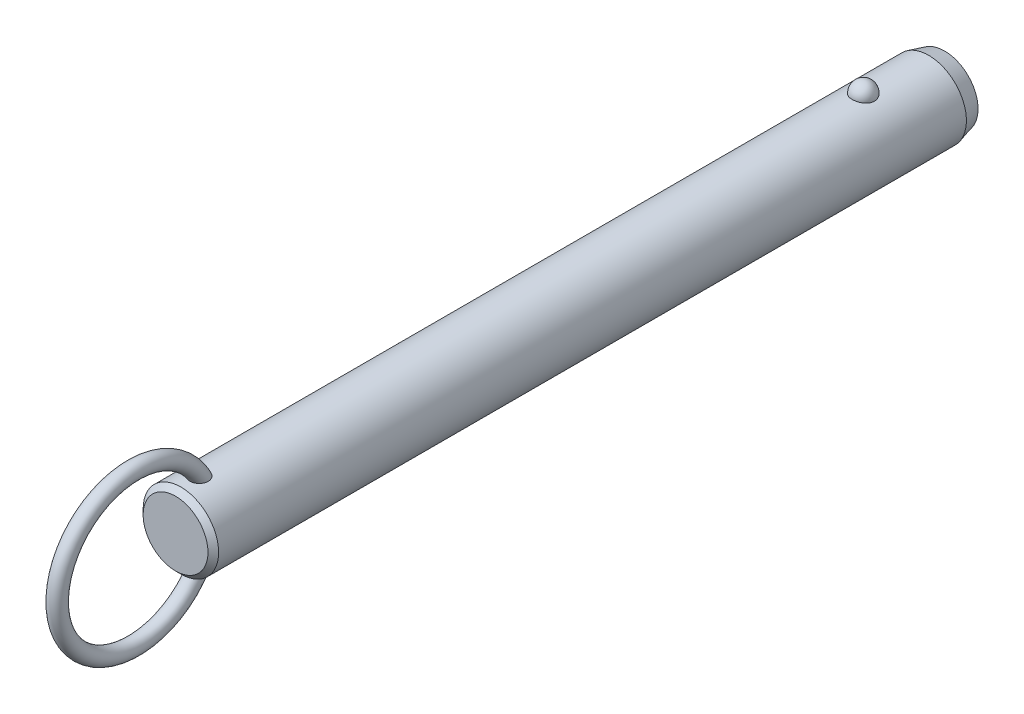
ISO-10303-21;
HEADER;
FILE_DESCRIPTION(('STEP AP214'),'2;1');
FILE_NAME('part.step','',(''),(''),'','','');
FILE_SCHEMA(('AUTOMOTIVE_DESIGN { 1 0 10303 214 1 1 1 1 }'));
ENDSEC;
DATA;
#1=APPLICATION_CONTEXT('core data for automotive mechanical design processes');
#2=APPLICATION_PROTOCOL_DEFINITION('international standard','automotive_design',2000,#1);
#3=PRODUCT_CONTEXT('',#1,'mechanical');
#4=PRODUCT('Part','Part','',(#3));
#5=PRODUCT_RELATED_PRODUCT_CATEGORY('part','',(#4));
#6=PRODUCT_DEFINITION_FORMATION('','',#4);
#7=PRODUCT_DEFINITION_CONTEXT('part definition',#1,'design');
#8=PRODUCT_DEFINITION('design','',#6,#7);
#9=PRODUCT_DEFINITION_SHAPE('','',#8);
#10=(LENGTH_UNIT() NAMED_UNIT(*) SI_UNIT(.MILLI.,.METRE.));
#11=(NAMED_UNIT(*) PLANE_ANGLE_UNIT() SI_UNIT($,.RADIAN.));
#12=(NAMED_UNIT(*) SI_UNIT($,.STERADIAN.) SOLID_ANGLE_UNIT());
#13=UNCERTAINTY_MEASURE_WITH_UNIT(LENGTH_MEASURE(1.E-05),#10,'distance_accuracy_value','');
#14=(GEOMETRIC_REPRESENTATION_CONTEXT(3) GLOBAL_UNCERTAINTY_ASSIGNED_CONTEXT((#13)) GLOBAL_UNIT_ASSIGNED_CONTEXT((#10,
#11,#12)) REPRESENTATION_CONTEXT('',''));
#15=CARTESIAN_POINT('',(0.,0.,0.));
#16=DIRECTION('',(0.,0.,1.));
#17=DIRECTION('',(1.,0.,0.));
#18=AXIS2_PLACEMENT_3D('',#15,#16,#17);
#19=CARTESIAN_POINT('',(0.,0.,119.4));
#20=DIRECTION('',(0.,0.,-1.));
#21=DIRECTION('',(-1.,0.,0.));
#22=AXIS2_PLACEMENT_3D('',#19,#20,#21);
#23=CYLINDRICAL_SURFACE('',#22,7.1);
#24=CARTESIAN_POINT('',(2.0769088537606,6.78943661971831,-2.1));
#25=CARTESIAN_POINT('',(2.07690739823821,6.78943796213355,-1.98268154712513));
#26=CARTESIAN_POINT('',(2.06738130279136,6.79237331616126,-1.86534506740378));
#27=CARTESIAN_POINT('',(2.0295040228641,6.8037853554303,-1.63400788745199));
#28=CARTESIAN_POINT('',(2.00114757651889,6.81226358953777,-1.52000812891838));
#29=CARTESIAN_POINT('',(1.92632025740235,6.83379798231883,-1.29863433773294));
#30=CARTESIAN_POINT('',(1.87985726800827,6.84685214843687,-1.19125744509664));
#31=CARTESIAN_POINT('',(1.76995205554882,6.87608091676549,-0.98604657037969));
#32=CARTESIAN_POINT('',(1.70650980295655,6.8922555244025,-0.88821260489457));
#33=CARTESIAN_POINT('',(1.5638119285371,6.92602930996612,-0.704242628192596));
#34=CARTESIAN_POINT('',(1.4844714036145,6.94363582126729,-0.618173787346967));
#35=CARTESIAN_POINT('',(1.31221746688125,6.97823658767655,-0.460740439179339));
#36=CARTESIAN_POINT('',(1.21930409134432,6.99523084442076,-0.389375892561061));
#37=CARTESIAN_POINT('',(1.02268781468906,7.02666176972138,-0.263547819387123));
#38=CARTESIAN_POINT('',(0.91902009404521,7.04110638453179,-0.209031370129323));
#39=CARTESIAN_POINT('',(0.703548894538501,7.06588726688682,-0.118163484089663));
#40=CARTESIAN_POINT('',(0.591746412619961,7.07622403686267,-0.0818098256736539));
#41=CARTESIAN_POINT('',(0.365557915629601,7.09147068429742,-0.0288711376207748));
#42=CARTESIAN_POINT('',(0.251267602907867,7.09648447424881,-0.0119070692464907));
#43=CARTESIAN_POINT('',(0.0213499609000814,7.10089837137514,0.00304925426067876));
#44=CARTESIAN_POINT('',(-0.0942772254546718,7.10029907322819,0.00104351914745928));
#45=CARTESIAN_POINT('',(-0.321651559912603,7.09360829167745,-0.0216931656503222));
#46=CARTESIAN_POINT('',(-0.433431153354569,7.08760388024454,-0.0421272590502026));
#47=CARTESIAN_POINT('',(-0.651862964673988,7.07086131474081,-0.100729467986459));
#48=CARTESIAN_POINT('',(-0.758515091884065,7.06012307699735,-0.138897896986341));
#49=CARTESIAN_POINT('',(-0.964449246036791,7.03496097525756,-0.232213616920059));
#50=CARTESIAN_POINT('',(-1.06368095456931,7.02051445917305,-0.287465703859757));
#51=CARTESIAN_POINT('',(-1.25145353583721,6.98948740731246,-0.413383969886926));
#52=CARTESIAN_POINT('',(-1.33999321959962,6.97290663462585,-0.48405186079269));
#53=CARTESIAN_POINT('',(-1.50591604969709,6.93898770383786,-0.640594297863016));
#54=CARTESIAN_POINT('',(-1.58302488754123,6.92164094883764,-0.726757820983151));
#55=CARTESIAN_POINT('',(-1.72189320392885,6.8884103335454,-0.91092752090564));
#56=CARTESIAN_POINT('',(-1.78365144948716,6.87252659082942,-1.008934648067));
#57=CARTESIAN_POINT('',(-1.89101272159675,6.84377189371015,-1.21549497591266));
#58=CARTESIAN_POINT('',(-1.93639553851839,6.83094274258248,-1.32416860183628));
#59=CARTESIAN_POINT('',(-2.00874275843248,6.81002070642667,-1.54791500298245));
#60=CARTESIAN_POINT('',(-2.03570774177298,6.80192767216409,-1.66298757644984));
#61=CARTESIAN_POINT('',(-2.07047276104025,6.7914266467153,-1.89571453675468));
#62=CARTESIAN_POINT('',(-2.07835878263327,6.78899315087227,-2.01335491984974));
#63=CARTESIAN_POINT('',(-2.07502083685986,6.79001409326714,-2.24833570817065));
#64=CARTESIAN_POINT('',(-2.06379746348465,6.7934683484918,-2.36567612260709));
#65=CARTESIAN_POINT('',(-2.02263913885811,6.80583442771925,-2.59603194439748));
#66=CARTESIAN_POINT('',(-1.99281127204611,6.81471501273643,-2.70906820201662));
#67=CARTESIAN_POINT('',(-1.91526639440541,6.83691232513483,-2.92836575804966));
#68=CARTESIAN_POINT('',(-1.8675486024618,6.85022924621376,-3.03462676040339));
#69=CARTESIAN_POINT('',(-1.75504492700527,6.87991336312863,-3.23806487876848));
#70=CARTESIAN_POINT('',(-1.69015924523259,6.89629822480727,-3.33518422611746));
#71=CARTESIAN_POINT('',(-1.54505404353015,6.93024852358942,-3.51697105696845));
#72=CARTESIAN_POINT('',(-1.46483385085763,6.94781401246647,-3.60163799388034));
#73=CARTESIAN_POINT('',(-1.29071406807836,6.98225977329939,-3.75654119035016));
#74=CARTESIAN_POINT('',(-1.19675650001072,6.99913673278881,-3.82671308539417));
#75=CARTESIAN_POINT('',(-0.997940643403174,7.03023618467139,-3.9501837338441));
#76=CARTESIAN_POINT('',(-0.89308318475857,7.04445887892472,-4.00348377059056));
#77=CARTESIAN_POINT('',(-0.676902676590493,7.06848365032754,-4.09107242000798));
#78=CARTESIAN_POINT('',(-0.565686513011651,7.0783430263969,-4.12560889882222));
#79=CARTESIAN_POINT('',(-0.338739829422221,7.09282534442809,-4.17575450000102));
#80=CARTESIAN_POINT('',(-0.223009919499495,7.09744899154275,-4.19136617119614));
#81=CARTESIAN_POINT('',(0.00707628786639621,7.10090930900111,-4.20307965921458));
#82=CARTESIAN_POINT('',(0.121410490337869,7.09986531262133,-4.19958377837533));
#83=CARTESIAN_POINT('',(0.347815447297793,7.092380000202,-4.17411564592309));
#84=CARTESIAN_POINT('',(0.459886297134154,7.08593891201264,-4.15214417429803));
#85=CARTESIAN_POINT('',(0.678084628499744,7.06838983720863,-4.09049562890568));
#86=CARTESIAN_POINT('',(0.784237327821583,7.05730369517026,-4.05090137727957));
#87=CARTESIAN_POINT('',(0.988305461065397,7.03163139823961,-3.95511447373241));
#88=CARTESIAN_POINT('',(1.08622031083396,7.01704499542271,-3.89892064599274));
#89=CARTESIAN_POINT('',(1.27284490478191,6.98562668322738,-3.77035541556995));
#90=CARTESIAN_POINT('',(1.36137372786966,6.96876135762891,-3.69772964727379));
#91=CARTESIAN_POINT('',(1.52509486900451,6.93477412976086,-3.53878279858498));
#92=CARTESIAN_POINT('',(1.60028496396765,6.91765218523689,-3.45245943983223));
#93=CARTESIAN_POINT('',(1.73681688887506,6.88465753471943,-3.26658774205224));
#94=CARTESIAN_POINT('',(1.79785966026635,6.86881574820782,-3.16681408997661));
#95=CARTESIAN_POINT('',(1.90265327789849,6.84053157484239,-2.95814408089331));
#96=CARTESIAN_POINT('',(1.94640861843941,6.82808830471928,-2.84925010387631));
#97=CARTESIAN_POINT('',(2.01274378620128,6.80881460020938,-2.63454318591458));
#98=CARTESIAN_POINT('',(2.03676193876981,6.80160856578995,-2.52920574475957));
#99=CARTESIAN_POINT('',(2.06884490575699,6.79191902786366,-2.3159172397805));
#100=CARTESIAN_POINT('',(2.07691019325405,6.78943538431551,-2.20796625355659));
#101=CARTESIAN_POINT('',(2.0769088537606,6.78943661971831,-2.1));
#102=B_SPLINE_CURVE_WITH_KNOTS('',3,(#24,#25,#26,#27,#28,#29,#30,#31,#32,#33,#34,#35,#36,#37,
#38,#39,#40,#41,#42,#43,#44,#45,#46,#47,#48,#49,#50,#51,#52,#53,#54,#55,#56,#57,#58,#59,#60,#61,
#62,#63,#64,#65,#66,#67,#68,#69,#70,#71,#72,#73,#74,#75,#76,#77,#78,#79,#80,#81,#82,#83,#84,#85,
#86,#87,#88,#89,#90,#91,#92,#93,#94,#95,#96,#97,#98,#99,#100,#101),.UNSPECIFIED.,.T.,.F.,(4,2,2,
2,2,2,2,2,2,2,2,2,2,2,2,2,2,2,2,2,2,2,2,2,2,2,2,2,2,2,2,2,2,2,2,2,2,2,4),(0.,0.351568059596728,
0.703234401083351,1.05474780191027,1.40626181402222,1.75970563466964,2.11314851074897,
2.4654696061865,2.81774759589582,3.16301449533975,3.50824481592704,3.84801136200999,
4.18778391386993,4.52968352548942,4.87162112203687,5.22076181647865,5.56993054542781,
5.92363364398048,6.27732559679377,6.62942052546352,6.98150450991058,7.33158042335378,
7.68167162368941,8.03384443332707,8.38603269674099,8.73975272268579,9.09344583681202,
9.44234545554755,9.79119807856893,10.1327344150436,10.4742563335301,10.8141898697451,
11.1541474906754,11.4997793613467,11.8454687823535,12.1979079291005,12.5502553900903,
12.8738073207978,13.1973496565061),.UNSPECIFIED.);
#103=CARTESIAN_POINT('',(2.0769088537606,6.78943661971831,-2.1));
#104=VERTEX_POINT('',#103);
#105=EDGE_CURVE('E41',#104,#104,#102,.T.);
#106=ORIENTED_EDGE('',*,*,#105,.T.);
#107=EDGE_LOOP('',(#106));
#108=FACE_BOUND('',#107,.T.);
#109=CARTESIAN_POINT('',(0.,0.,126.32));
#110=DIRECTION('',(0.,0.,1.));
#111=DIRECTION('',(1.,0.,0.));
#112=AXIS2_PLACEMENT_3D('',#109,#110,#111);
#113=CIRCLE('',#112,7.1);
#114=CARTESIAN_POINT('',(7.1,0.,126.32));
#115=VERTEX_POINT('',#114);
#116=EDGE_CURVE('E10',#115,#115,#113,.F.);
#117=ORIENTED_EDGE('',*,*,#116,.T.);
#118=EDGE_LOOP('',(#117));
#119=FACE_BOUND('',#118,.T.);
#120=CARTESIAN_POINT('',(-0.429539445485,-7.08699541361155,121.142921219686));
#121=CARTESIAN_POINT('',(-0.508331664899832,-7.08221999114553,121.166876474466));
#122=CARTESIAN_POINT('',(-0.58503984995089,-7.07624016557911,121.197457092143));
#123=CARTESIAN_POINT('',(-0.732082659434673,-7.06254296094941,121.271024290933));
#124=CARTESIAN_POINT('',(-0.802417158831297,-7.05482554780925,121.314011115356));
#125=CARTESIAN_POINT('',(-0.934722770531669,-7.03851844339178,121.411113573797));
#126=CARTESIAN_POINT('',(-0.99670020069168,-7.02992941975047,121.465220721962));
#127=CARTESIAN_POINT('',(-1.11079942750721,-7.01280697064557,121.582967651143));
#128=CARTESIAN_POINT('',(-1.16292136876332,-7.00427354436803,121.646607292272));
#129=CARTESIAN_POINT('',(-1.25705660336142,-6.98799959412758,121.782687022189));
#130=CARTESIAN_POINT('',(-1.2988803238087,-6.98027525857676,121.855259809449));
#131=CARTESIAN_POINT('',(-1.37069920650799,-6.96652886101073,122.006168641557));
#132=CARTESIAN_POINT('',(-1.40069157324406,-6.96050720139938,122.084506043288));
#133=CARTESIAN_POINT('',(-1.45043507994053,-6.95031881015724,122.250190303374));
#134=CARTESIAN_POINT('',(-1.46937115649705,-6.94630231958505,122.337789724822));
#135=CARTESIAN_POINT('',(-1.49424917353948,-6.94099239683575,122.514871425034));
#136=CARTESIAN_POINT('',(-1.50018601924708,-6.93970003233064,122.604354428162));
#137=CARTESIAN_POINT('',(-1.49978214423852,-6.93978815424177,122.794060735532));
#138=CARTESIAN_POINT('',(-1.49187639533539,-6.94150934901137,122.894279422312));
#139=CARTESIAN_POINT('',(-1.46177925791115,-6.94790814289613,123.092479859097));
#140=CARTESIAN_POINT('',(-1.43957541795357,-6.95258831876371,123.190459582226));
#141=CARTESIAN_POINT('',(-1.37783293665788,-6.96510647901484,123.39536292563));
#142=CARTESIAN_POINT('',(-1.33634073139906,-6.97328848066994,123.501680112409));
#143=CARTESIAN_POINT('',(-1.23686994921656,-6.99161706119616,123.706177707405));
#144=CARTESIAN_POINT('',(-1.17889192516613,-7.00176357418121,123.804358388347));
#145=CARTESIAN_POINT('',(-1.0587512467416,-7.02082898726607,123.972374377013));
#146=CARTESIAN_POINT('',(-0.999247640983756,-7.02963746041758,124.044123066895));
#147=CARTESIAN_POINT('',(-0.869494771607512,-7.04686074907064,124.177195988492));
#148=CARTESIAN_POINT('',(-0.799263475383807,-7.05527619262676,124.238537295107));
#149=CARTESIAN_POINT('',(-0.665408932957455,-7.06899457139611,124.335131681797));
#150=CARTESIAN_POINT('',(-0.603817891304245,-7.07457275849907,124.373151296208));
#151=CARTESIAN_POINT('',(-0.47517283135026,-7.08437420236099,124.438758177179));
#152=CARTESIAN_POINT('',(-0.408123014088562,-7.08859848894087,124.466353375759));
#153=CARTESIAN_POINT('',(-0.269431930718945,-7.09522749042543,124.509256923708));
#154=CARTESIAN_POINT('',(-0.197757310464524,-7.09761688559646,124.524461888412));
#155=CARTESIAN_POINT('',(-0.0527849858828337,-7.10017268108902,124.540716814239));
#156=CARTESIAN_POINT('',(0.0205115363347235,-7.10034065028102,124.541776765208));
#157=CARTESIAN_POINT('',(0.156426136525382,-7.09855986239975,124.530461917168));
#158=CARTESIAN_POINT('',(0.219199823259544,-7.09688191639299,124.519806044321));
#159=CARTESIAN_POINT('',(0.342134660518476,-7.09201880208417,124.488537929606));
#160=CARTESIAN_POINT('',(0.402295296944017,-7.08883333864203,124.467923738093));
#161=CARTESIAN_POINT('',(0.520687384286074,-7.08113868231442,124.417212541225));
#162=CARTESIAN_POINT('',(0.578791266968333,-7.07658958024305,124.386827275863));
#163=CARTESIAN_POINT('',(0.690173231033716,-7.06659708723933,124.318367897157));
#164=CARTESIAN_POINT('',(0.743447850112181,-7.061153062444,124.280288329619));
#165=CARTESIAN_POINT('',(0.870947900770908,-7.04680292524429,124.176592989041));
#166=CARTESIAN_POINT('',(0.941828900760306,-7.0375580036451,124.106897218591));
#167=CARTESIAN_POINT('',(1.07136606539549,-7.01900793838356,123.956945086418));
#168=CARTESIAN_POINT('',(1.13000013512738,-7.00970271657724,123.876670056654));
#169=CARTESIAN_POINT('',(1.23579584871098,-6.99183327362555,123.706899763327));
#170=CARTESIAN_POINT('',(1.2827427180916,-6.98328455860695,123.617269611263));
#171=CARTESIAN_POINT('',(1.36351442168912,-6.96796352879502,123.432176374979));
#172=CARTESIAN_POINT('',(1.39733971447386,-6.96119115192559,123.336713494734));
#173=CARTESIAN_POINT('',(1.45579181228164,-6.94922464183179,123.12530928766));
#174=CARTESIAN_POINT('',(1.47790145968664,-6.94449000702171,123.008631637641));
#175=CARTESIAN_POINT('',(1.50168752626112,-6.93938731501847,122.773015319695));
#176=CARTESIAN_POINT('',(1.50336085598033,-6.93901991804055,122.65407631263));
#177=CARTESIAN_POINT('',(1.48486516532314,-6.9430010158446,122.42360799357));
#178=CARTESIAN_POINT('',(1.46573441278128,-6.9471253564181,122.311995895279));
#179=CARTESIAN_POINT('',(1.40606892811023,-6.95944667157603,122.094886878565));
#180=CARTESIAN_POINT('',(1.36556446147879,-6.96763788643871,121.9893815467));
#181=CARTESIAN_POINT('',(1.27082700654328,-6.98548038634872,121.804287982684));
#182=CARTESIAN_POINT('',(1.21949810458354,-6.99473841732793,121.723171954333));
#183=CARTESIAN_POINT('',(1.10242050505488,-7.01414069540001,121.572227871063));
#184=CARTESIAN_POINT('',(1.03668119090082,-7.02428436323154,121.50239252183));
#185=CARTESIAN_POINT('',(0.900559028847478,-7.04295285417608,121.383573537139));
#186=CARTESIAN_POINT('',(0.83142884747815,-7.05153466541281,121.333157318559));
#187=CARTESIAN_POINT('',(0.68529187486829,-7.06723150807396,121.245142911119));
#188=CARTESIAN_POINT('',(0.608287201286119,-7.0743469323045,121.207541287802));
#189=CARTESIAN_POINT('',(0.451878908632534,-7.08602232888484,121.147491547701));
#190=CARTESIAN_POINT('',(0.372686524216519,-7.09067127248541,121.124508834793));
#191=CARTESIAN_POINT('',(0.211477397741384,-7.09730788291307,121.092035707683));
#192=CARTESIAN_POINT('',(0.129460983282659,-7.09929585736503,121.08254373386));
#193=CARTESIAN_POINT('',(-0.0332905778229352,-7.10037858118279,121.077351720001));
#194=CARTESIAN_POINT('',(-0.11401636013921,-7.09953334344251,121.081365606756));
#195=CARTESIAN_POINT('',(-0.273670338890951,-7.09517338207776,121.102454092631));
#196=CARTESIAN_POINT('',(-0.352598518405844,-7.09165863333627,121.119528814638));
#197=CARTESIAN_POINT('',(-0.429539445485,-7.08699541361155,121.142921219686));
#198=B_SPLINE_CURVE_WITH_KNOTS('',3,(#120,#121,#122,#123,#124,#125,#126,#127,#128,#129,#130,
#131,#132,#133,#134,#135,#136,#137,#138,#139,#140,#141,#142,#143,#144,#145,#146,#147,#148,#149,
#150,#151,#152,#153,#154,#155,#156,#157,#158,#159,#160,#161,#162,#163,#164,#165,#166,#167,#168,
#169,#170,#171,#172,#173,#174,#175,#176,#177,#178,#179,#180,#181,#182,#183,#184,#185,#186,#187,
#188,#189,#190,#191,#192,#193,#194,#195,#196,#197),.UNSPECIFIED.,.T.,.F.,(4,2,2,2,2,2,2,2,2,2,2,
2,2,2,2,2,2,2,2,2,2,2,2,2,2,2,2,2,2,2,2,2,2,2,2,2,2,2,4),(0.,0.247183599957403,
0.494372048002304,0.741372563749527,0.988369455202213,1.23962059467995,1.49093106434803,
1.75897818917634,2.02713035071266,2.3275826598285,2.62829697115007,2.97008736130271,
3.31186629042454,3.59175319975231,3.87117637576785,4.08813841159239,4.30493502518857,
4.52352259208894,4.74195577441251,4.9321532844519,5.12238804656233,5.31884850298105,
5.51544871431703,5.81332317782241,6.11173048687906,6.4152726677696,6.71880423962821,
7.073581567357,7.42841252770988,7.76631485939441,8.10373999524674,8.39142246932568,
8.67891817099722,8.93560332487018,9.19221962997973,9.43881106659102,9.68537399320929,
9.92674752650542,10.1681233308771),.UNSPECIFIED.);
#199=CARTESIAN_POINT('',(-0.429539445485,-7.08699541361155,121.142921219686));
#200=VERTEX_POINT('',#199);
#201=EDGE_CURVE('E60',#200,#200,#198,.T.);
#202=ORIENTED_EDGE('',*,*,#201,.T.);
#203=EDGE_LOOP('',(#202));
#204=FACE_BOUND('',#203,.T.);
#205=CARTESIAN_POINT('',(-0.429539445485,7.08699541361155,121.142921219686));
#206=CARTESIAN_POINT('',(-0.351665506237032,7.09171429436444,121.119246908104));
#207=CARTESIAN_POINT('',(-0.271733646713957,7.09525896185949,121.102036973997));
#208=CARTESIAN_POINT('',(-0.110026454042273,7.09960839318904,121.081005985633));
#209=CARTESIAN_POINT('',(-0.028250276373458,7.10041187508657,121.077191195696));
#210=CARTESIAN_POINT('',(0.134782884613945,7.09918849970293,121.083059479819));
#211=CARTESIAN_POINT('',(0.21603995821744,7.09716214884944,121.09274013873));
#212=CARTESIAN_POINT('',(0.375730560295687,7.09050177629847,121.125347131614));
#213=CARTESIAN_POINT('',(0.454164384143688,7.08586802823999,121.148272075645));
#214=CARTESIAN_POINT('',(0.60602533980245,7.07449911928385,121.206771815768));
#215=CARTESIAN_POINT('',(0.679451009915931,7.06776334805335,121.242350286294));
#216=CARTESIAN_POINT('',(0.819234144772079,7.05292866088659,121.325175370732));
#217=CARTESIAN_POINT('',(0.885591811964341,7.04482978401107,121.372421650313));
#218=CARTESIAN_POINT('',(1.00993211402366,7.02808709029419,121.477590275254));
#219=CARTESIAN_POINT('',(1.06785399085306,7.01943990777,121.535583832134));
#220=CARTESIAN_POINT('',(1.17342527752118,7.00256662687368,121.660301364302));
#221=CARTESIAN_POINT('',(1.22107408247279,6.99434055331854,121.727025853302));
#222=CARTESIAN_POINT('',(1.30652927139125,6.97889183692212,121.869362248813));
#223=CARTESIAN_POINT('',(1.34399711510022,6.97170674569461,121.945180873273));
#224=CARTESIAN_POINT('',(1.40682616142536,6.95930080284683,122.101810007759));
#225=CARTESIAN_POINT('',(1.43218374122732,6.95408053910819,122.18262200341));
#226=CARTESIAN_POINT('',(1.47246409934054,6.94566853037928,122.353531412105));
#227=CARTESIAN_POINT('',(1.48642590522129,6.9426653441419,122.44386307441));
#228=CARTESIAN_POINT('',(1.5011410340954,6.93949744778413,122.625619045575));
#229=CARTESIAN_POINT('',(1.50188917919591,6.93933385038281,122.717043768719));
#230=CARTESIAN_POINT('',(1.49030464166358,6.94183245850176,122.91084381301));
#231=CARTESIAN_POINT('',(1.47627413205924,6.94486147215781,123.013112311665));
#232=CARTESIAN_POINT('',(1.43356351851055,6.95380194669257,123.214471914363));
#233=CARTESIAN_POINT('',(1.4048676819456,6.95971650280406,123.313559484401));
#234=CARTESIAN_POINT('',(1.32908750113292,6.97461208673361,123.518908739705));
#235=CARTESIAN_POINT('',(1.28011435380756,6.98388945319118,123.624456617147));
#236=CARTESIAN_POINT('',(1.16520357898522,7.00397743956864,123.825760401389));
#237=CARTESIAN_POINT('',(1.09927694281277,7.01478706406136,123.921522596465));
#238=CARTESIAN_POINT('',(0.969361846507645,7.03373936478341,124.076756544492));
#239=CARTESIAN_POINT('',(0.909042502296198,7.04187023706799,124.139303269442));
#240=CARTESIAN_POINT('',(0.77917855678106,7.0574173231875,124.254053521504));
#241=CARTESIAN_POINT('',(0.70964977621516,7.06483472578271,124.306274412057));
#242=CARTESIAN_POINT('',(0.576854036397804,7.0767751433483,124.388113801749));
#243=CARTESIAN_POINT('',(0.515118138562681,7.08158033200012,124.420164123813));
#244=CARTESIAN_POINT('',(0.387127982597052,7.08972701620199,124.473765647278));
#245=CARTESIAN_POINT('',(0.320877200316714,7.09306962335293,124.495324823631));
#246=CARTESIAN_POINT('',(0.185041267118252,7.09791507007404,124.526400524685));
#247=CARTESIAN_POINT('',(0.115437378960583,7.09940591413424,124.535838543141));
#248=CARTESIAN_POINT('',(-0.0243157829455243,7.10030171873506,124.541522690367));
#249=CARTESIAN_POINT('',(-0.0944648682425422,7.0997073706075,124.537773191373));
#250=CARTESIAN_POINT('',(-0.225713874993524,7.09668414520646,124.518508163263));
#251=CARTESIAN_POINT('',(-0.287006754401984,7.09444865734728,124.504232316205));
#252=CARTESIAN_POINT('',(-0.40655537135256,7.08860360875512,124.466368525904));
#253=CARTESIAN_POINT('',(-0.46480981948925,7.08499346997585,124.442776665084));
#254=CARTESIAN_POINT('',(-0.594955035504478,7.07541654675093,124.378923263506));
#255=CARTESIAN_POINT('',(-0.665389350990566,7.06906574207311,124.335753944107));
#256=CARTESIAN_POINT('',(-0.798242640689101,7.05530261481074,124.238587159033));
#257=CARTESIAN_POINT('',(-0.860645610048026,7.0478882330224,124.184568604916));
#258=CARTESIAN_POINT('',(-0.994249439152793,7.03045217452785,124.050996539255));
#259=CARTESIAN_POINT('',(-1.06260129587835,7.02030745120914,123.968614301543));
#260=CARTESIAN_POINT('',(-1.18502045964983,7.00068382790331,123.793843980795));
#261=CARTESIAN_POINT('',(-1.23907684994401,6.99120544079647,123.701448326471));
#262=CARTESIAN_POINT('',(-1.33335589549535,6.97384343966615,123.508008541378));
#263=CARTESIAN_POINT('',(-1.3733613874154,6.96598557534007,123.406856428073));
#264=CARTESIAN_POINT('',(-1.43770677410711,6.9529905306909,123.199504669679));
#265=CARTESIAN_POINT('',(-1.46204473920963,6.94785368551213,123.09330440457));
#266=CARTESIAN_POINT('',(-1.49537533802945,6.94076296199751,122.868231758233));
#267=CARTESIAN_POINT('',(-1.50273564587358,6.93914842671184,122.74909751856));
#268=CARTESIAN_POINT('',(-1.4954555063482,6.94072368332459,122.511470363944));
#269=CARTESIAN_POINT('',(-1.48082914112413,6.94391040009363,122.392977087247));
#270=CARTESIAN_POINT('',(-1.43076401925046,6.95438579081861,122.173432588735));
#271=CARTESIAN_POINT('',(-1.39762227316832,6.96121852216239,122.071841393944));
#272=CARTESIAN_POINT('',(-1.31211274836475,6.97783941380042,121.877351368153));
#273=CARTESIAN_POINT('',(-1.2597660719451,6.98762432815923,121.78444313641));
#274=CARTESIAN_POINT('',(-1.14583073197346,7.00713153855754,121.624160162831));
#275=CARTESIAN_POINT('',(-1.0866594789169,7.01665982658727,121.555035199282));
#276=CARTESIAN_POINT('',(-0.956606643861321,7.03556646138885,121.428878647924));
#277=CARTESIAN_POINT('',(-0.88573712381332,7.04494495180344,121.371834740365));
#278=CARTESIAN_POINT('',(-0.75155804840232,7.06035735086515,121.283100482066));
#279=CARTESIAN_POINT('',(-0.690120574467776,7.0666695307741,121.248593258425));
#280=CARTESIAN_POINT('',(-0.562815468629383,7.07794609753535,121.188750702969));
#281=CARTESIAN_POINT('',(-0.496948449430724,7.08291067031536,121.163414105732));
#282=CARTESIAN_POINT('',(-0.429539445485,7.08699541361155,121.142921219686));
#283=B_SPLINE_CURVE_WITH_KNOTS('',3,(#205,#206,#207,#208,#209,#210,#211,#212,#213,#214,#215,
#216,#217,#218,#219,#220,#221,#222,#223,#224,#225,#226,#227,#228,#229,#230,#231,#232,#233,#234,
#235,#236,#237,#238,#239,#240,#241,#242,#243,#244,#245,#246,#247,#248,#249,#250,#251,#252,#253,
#254,#255,#256,#257,#258,#259,#260,#261,#262,#263,#264,#265,#266,#267,#268,#269,#270,#271,#272,
#273,#274,#275,#276,#277,#278,#279,#280,#281,#282),.UNSPECIFIED.,.T.,.F.,(4,2,2,2,2,2,2,2,2,2,2,
2,2,2,2,2,2,2,2,2,2,2,2,2,2,2,2,2,2,2,2,2,2,2,2,2,2,2,4),(0.,0.244335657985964,
0.488785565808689,0.733191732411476,0.977572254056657,1.22202379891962,1.46646834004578,
1.71259457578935,1.95873529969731,2.21226768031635,2.46587585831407,2.7391381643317,
3.01250754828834,3.32109936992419,3.63002293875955,3.97863512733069,4.32702187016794,
4.5879394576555,4.84841449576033,5.05676704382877,5.26496096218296,5.47449661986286,
5.68396281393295,5.87205447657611,6.06022532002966,6.30743751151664,6.55513496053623,
6.87602468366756,7.19715875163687,7.52305774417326,7.84899686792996,8.20516155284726,
8.56109821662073,8.88040084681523,9.19935367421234,9.47236282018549,9.74509220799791,
9.9566225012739,10.1681235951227),.UNSPECIFIED.);
#284=CARTESIAN_POINT('',(-0.429539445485,7.08699541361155,121.142921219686));
#285=VERTEX_POINT('',#284);
#286=EDGE_CURVE('E68',#285,#285,#283,.T.);
#287=ORIENTED_EDGE('',*,*,#286,.T.);
#288=EDGE_LOOP('',(#287));
#289=FACE_BOUND('',#288,.T.);
#290=CARTESIAN_POINT('',(0.,0.,-14.4));
#291=DIRECTION('',(0.,0.,-1.));
#292=DIRECTION('',(-1.,0.,0.));
#293=AXIS2_PLACEMENT_3D('',#290,#291,#292);
#294=CIRCLE('',#293,7.1);
#295=CARTESIAN_POINT('',(-7.1,0.,-14.4));
#296=VERTEX_POINT('',#295);
#297=EDGE_CURVE('E57',#296,#296,#294,.F.);
#298=ORIENTED_EDGE('',*,*,#297,.T.);
#299=EDGE_LOOP('',(#298));
#300=FACE_BOUND('',#299,.T.);
#301=ADVANCED_FACE('F37',(#108,#119,#204,#289,#300),#23,.T.);
#302=CARTESIAN_POINT('',(0.,0.,-17.4));
#303=DIRECTION('',(0.,0.,-1.));
#304=DIRECTION('',(-1.,0.,0.));
#305=AXIS2_PLACEMENT_3D('',#302,#303,#304);
#306=PLANE('',#305);
#307=CARTESIAN_POINT('',(0.,0.,-17.4));
#308=DIRECTION('',(0.,0.,-1.));
#309=DIRECTION('',(-1.,0.,0.));
#310=AXIS2_PLACEMENT_3D('',#307,#308,#309);
#311=CIRCLE('',#310,6.29615242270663);
#312=CARTESIAN_POINT('',(-6.29615242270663,0.,-17.4));
#313=VERTEX_POINT('',#312);
#314=EDGE_CURVE('E67',#313,#313,#311,.T.);
#315=ORIENTED_EDGE('',*,*,#314,.T.);
#316=EDGE_LOOP('',(#315));
#317=FACE_BOUND('',#316,.T.);
#318=ADVANCED_FACE('F86',(#317),#306,.T.);
#319=CARTESIAN_POINT('',(0.,0.,-17.4));
#320=DIRECTION('',(0.,0.,1.));
#321=DIRECTION('',(1.,0.,0.));
#322=AXIS2_PLACEMENT_3D('',#319,#320,#321);
#323=CONICAL_SURFACE('',#322,6.29615242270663,0.261799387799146);
#324=ORIENTED_EDGE('',*,*,#297,.F.);
#325=EDGE_LOOP('',(#324));
#326=FACE_BOUND('',#325,.T.);
#327=ORIENTED_EDGE('',*,*,#314,.F.);
#328=EDGE_LOOP('',(#327));
#329=FACE_BOUND('',#328,.T.);
#330=ADVANCED_FACE('F84',(#326,#329),#323,.T.);
#331=CARTESIAN_POINT('',(0.,0.,127.32));
#332=DIRECTION('',(0.,0.,1.));
#333=DIRECTION('',(1.,0.,0.));
#334=AXIS2_PLACEMENT_3D('',#331,#332,#333);
#335=PLANE('',#334);
#336=CARTESIAN_POINT('',(0.,0.,127.32));
#337=DIRECTION('',(0.,0.,1.));
#338=DIRECTION('',(1.,0.,0.));
#339=AXIS2_PLACEMENT_3D('',#336,#337,#338);
#340=CIRCLE('',#339,6.09999999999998);
#341=CARTESIAN_POINT('',(6.09999999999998,0.,127.32));
#342=VERTEX_POINT('',#341);
#343=EDGE_CURVE('E50',#342,#342,#340,.T.);
#344=ORIENTED_EDGE('',*,*,#343,.T.);
#345=EDGE_LOOP('',(#344));
#346=FACE_BOUND('',#345,.T.);
#347=ADVANCED_FACE('F78',(#346),#335,.T.);
#348=CARTESIAN_POINT('',(0.,0.,135.25));
#349=DIRECTION('',(1.,0.,0.));
#350=DIRECTION('',(0.,0.,-1.));
#351=AXIS2_PLACEMENT_3D('',#348,#349,#350);
#352=TOROIDAL_SURFACE('',#351,14.35,1.5);
#353=ORIENTED_EDGE('',*,*,#286,.F.);
#354=EDGE_LOOP('',(#353));
#355=FACE_BOUND('',#354,.T.);
#356=ORIENTED_EDGE('',*,*,#201,.F.);
#357=EDGE_LOOP('',(#356));
#358=FACE_BOUND('',#357,.T.);
#359=ADVANCED_FACE('F74',(#355,#358),#352,.T.);
#360=CARTESIAN_POINT('',(0.,0.,127.32));
#361=DIRECTION('',(0.,0.,-1.));
#362=DIRECTION('',(-1.,0.,0.));
#363=AXIS2_PLACEMENT_3D('',#360,#361,#362);
#364=CONICAL_SURFACE('',#363,6.09999999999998,0.785398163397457);
#365=ORIENTED_EDGE('',*,*,#116,.F.);
#366=EDGE_LOOP('',(#365));
#367=FACE_BOUND('',#366,.T.);
#368=ORIENTED_EDGE('',*,*,#343,.F.);
#369=EDGE_LOOP('',(#368));
#370=FACE_BOUND('',#369,.T.);
#371=ADVANCED_FACE('F39',(#367,#370),#364,.T.);
#372=CARTESIAN_POINT('',(0.,7.1,-2.1));
#373=DIRECTION('',(0.,1.,0.));
#374=DIRECTION('',(0.,0.,1.));
#375=AXIS2_PLACEMENT_3D('',#372,#373,#374);
#376=SPHERICAL_SURFACE('',#375,2.10000000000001);
#377=ORIENTED_EDGE('',*,*,#105,.F.);
#378=EDGE_LOOP('',(#377));
#379=FACE_BOUND('',#378,.T.);
#380=ADVANCED_FACE('F80',(#379),#376,.T.);
#381=CLOSED_SHELL('',(#301,#318,#330,#347,#359,#371,#380));
#382=MANIFOLD_SOLID_BREP('B2',#381);
#383=ADVANCED_BREP_SHAPE_REPRESENTATION('',(#18,#382),#14);
#384=SHAPE_DEFINITION_REPRESENTATION(#9,#383);
ENDSEC;
END-ISO-10303-21;
